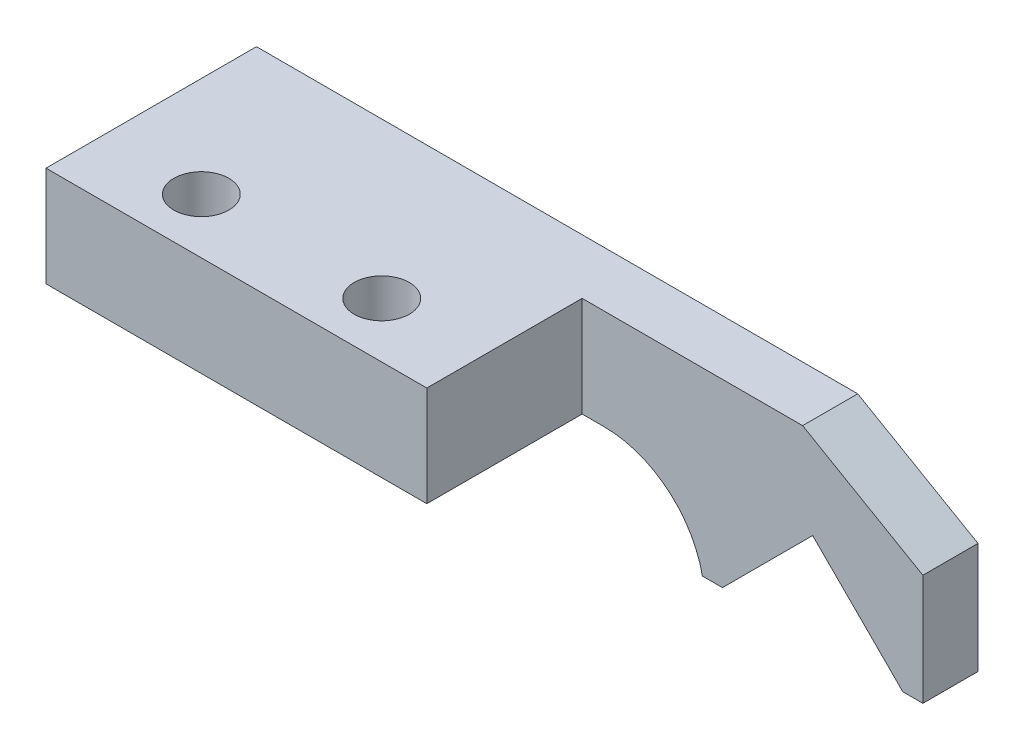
ISO-10303-21;
HEADER;
FILE_DESCRIPTION(('STEP AP214'),'2;1');
FILE_NAME('part.step','',(''),(''),'','','');
FILE_SCHEMA(('AUTOMOTIVE_DESIGN { 1 0 10303 214 1 1 1 1 }'));
ENDSEC;
DATA;
#1=APPLICATION_CONTEXT('core data for automotive mechanical design processes');
#2=APPLICATION_PROTOCOL_DEFINITION('international standard','automotive_design',2000,#1);
#3=PRODUCT_CONTEXT('',#1,'mechanical');
#4=PRODUCT('Part','Part','',(#3));
#5=PRODUCT_RELATED_PRODUCT_CATEGORY('part','',(#4));
#6=PRODUCT_DEFINITION_FORMATION('','',#4);
#7=PRODUCT_DEFINITION_CONTEXT('part definition',#1,'design');
#8=PRODUCT_DEFINITION('design','',#6,#7);
#9=PRODUCT_DEFINITION_SHAPE('','',#8);
#10=(LENGTH_UNIT() NAMED_UNIT(*) SI_UNIT(.MILLI.,.METRE.));
#11=(NAMED_UNIT(*) PLANE_ANGLE_UNIT() SI_UNIT($,.RADIAN.));
#12=(NAMED_UNIT(*) SI_UNIT($,.STERADIAN.) SOLID_ANGLE_UNIT());
#13=UNCERTAINTY_MEASURE_WITH_UNIT(LENGTH_MEASURE(1.E-05),#10,'distance_accuracy_value','');
#14=(GEOMETRIC_REPRESENTATION_CONTEXT(3) GLOBAL_UNCERTAINTY_ASSIGNED_CONTEXT((#13)) GLOBAL_UNIT_ASSIGNED_CONTEXT((#10,
#11,#12)) REPRESENTATION_CONTEXT('',''));
#15=CARTESIAN_POINT('',(0.,0.,0.));
#16=DIRECTION('',(0.,0.,1.));
#17=DIRECTION('',(1.,0.,0.));
#18=AXIS2_PLACEMENT_3D('',#15,#16,#17);
#19=CARTESIAN_POINT('',(40.2020410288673,-10.,21.));
#20=DIRECTION('',(0.,0.,-1.));
#21=DIRECTION('',(-1.,0.,0.));
#22=AXIS2_PLACEMENT_3D('',#19,#20,#21);
#23=CYLINDRICAL_SURFACE('',#22,10.);
#24=DIRECTION('',(0.,0.,-1.));
#25=VECTOR('',#24,1.);
#26=CARTESIAN_POINT('',(50.,-8.,21.));
#27=LINE('',#26,#25);
#28=CARTESIAN_POINT('',(50.,-8.,5.5));
#29=VERTEX_POINT('',#28);
#30=CARTESIAN_POINT('',(50.,-8.,0.));
#31=VERTEX_POINT('',#30);
#32=EDGE_CURVE('E201',#29,#31,#27,.T.);
#33=ORIENTED_EDGE('',*,*,#32,.F.);
#34=CARTESIAN_POINT('',(40.2020410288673,-10.,5.5));
#35=DIRECTION('',(0.,0.,1.));
#36=DIRECTION('',(1.,0.,0.));
#37=AXIS2_PLACEMENT_3D('',#34,#35,#36);
#38=CIRCLE('',#37,10.);
#39=CARTESIAN_POINT('',(40.2020410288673,0.,5.5));
#40=VERTEX_POINT('',#39);
#41=EDGE_CURVE('E158',#29,#40,#38,.T.);
#42=ORIENTED_EDGE('',*,*,#41,.T.);
#43=DIRECTION('',(0.,0.,-1.));
#44=VECTOR('',#43,1.);
#45=CARTESIAN_POINT('',(40.2020410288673,0.,21.));
#46=LINE('',#45,#44);
#47=CARTESIAN_POINT('',(40.2020410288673,0.,0.));
#48=VERTEX_POINT('',#47);
#49=EDGE_CURVE('E42',#40,#48,#46,.T.);
#50=ORIENTED_EDGE('',*,*,#49,.T.);
#51=CARTESIAN_POINT('',(40.2020410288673,-10.,0.));
#52=DIRECTION('',(0.,0.,1.));
#53=DIRECTION('',(1.,0.,0.));
#54=AXIS2_PLACEMENT_3D('',#51,#52,#53);
#55=CIRCLE('',#54,10.);
#56=EDGE_CURVE('E190',#31,#48,#55,.T.);
#57=ORIENTED_EDGE('',*,*,#56,.F.);
#58=EDGE_LOOP('',(#33,#42,#50,#57));
#59=FACE_BOUND('',#58,.T.);
#60=ADVANCED_FACE('F34',(#59),#23,.F.);
#61=CARTESIAN_POINT('',(52.,-8.,21.));
#62=DIRECTION('',(0.,-1.,0.));
#63=DIRECTION('',(0.,0.,-1.));
#64=AXIS2_PLACEMENT_3D('',#61,#62,#63);
#65=PLANE('',#64);
#66=DIRECTION('',(0.,0.,-1.));
#67=VECTOR('',#66,1.);
#68=CARTESIAN_POINT('',(52.,-8.,21.));
#69=LINE('',#68,#67);
#70=CARTESIAN_POINT('',(52.,-8.,5.5));
#71=VERTEX_POINT('',#70);
#72=CARTESIAN_POINT('',(52.,-8.,0.));
#73=VERTEX_POINT('',#72);
#74=EDGE_CURVE('E203',#71,#73,#69,.T.);
#75=ORIENTED_EDGE('',*,*,#74,.F.);
#76=DIRECTION('',(1.,0.,0.));
#77=VECTOR('',#76,1.);
#78=CARTESIAN_POINT('',(38.,-8.,5.5));
#79=LINE('',#78,#77);
#80=EDGE_CURVE('E128',#29,#71,#79,.T.);
#81=ORIENTED_EDGE('',*,*,#80,.F.);
#82=ORIENTED_EDGE('',*,*,#32,.T.);
#83=DIRECTION('',(-1.,0.,0.));
#84=VECTOR('',#83,1.);
#85=CARTESIAN_POINT('',(52.,-8.,0.));
#86=LINE('',#85,#84);
#87=EDGE_CURVE('E187',#73,#31,#86,.T.);
#88=ORIENTED_EDGE('',*,*,#87,.F.);
#89=EDGE_LOOP('',(#75,#81,#82,#88));
#90=FACE_BOUND('',#89,.T.);
#91=ADVANCED_FACE('F235',(#90),#65,.T.);
#92=CARTESIAN_POINT('',(52.,-8.,21.));
#93=DIRECTION('',(-0.707106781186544,0.707106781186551,0.));
#94=DIRECTION('',(-0.707106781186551,-0.707106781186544,0.));
#95=AXIS2_PLACEMENT_3D('',#92,#93,#94);
#96=PLANE('',#95);
#97=DIRECTION('',(0.707106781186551,0.707106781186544,0.));
#98=VECTOR('',#97,1.);
#99=CARTESIAN_POINT('',(52.,-8.,5.5));
#100=LINE('',#99,#98);
#101=CARTESIAN_POINT('',(61.0000000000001,0.999999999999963,5.5));
#102=VERTEX_POINT('',#101);
#103=EDGE_CURVE('E156',#71,#102,#100,.T.);
#104=ORIENTED_EDGE('',*,*,#103,.F.);
#105=ORIENTED_EDGE('',*,*,#74,.T.);
#106=DIRECTION('',(0.707106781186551,0.707106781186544,0.));
#107=VECTOR('',#106,1.);
#108=CARTESIAN_POINT('',(52.,-8.,0.));
#109=LINE('',#108,#107);
#110=CARTESIAN_POINT('',(61.0000000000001,0.999999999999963,0.));
#111=VERTEX_POINT('',#110);
#112=EDGE_CURVE('E184',#73,#111,#109,.T.);
#113=ORIENTED_EDGE('',*,*,#112,.T.);
#114=DIRECTION('',(0.,0.,-1.));
#115=VECTOR('',#114,1.);
#116=CARTESIAN_POINT('',(61.0000000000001,0.999999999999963,21.));
#117=LINE('',#116,#115);
#118=EDGE_CURVE('E205',#102,#111,#117,.T.);
#119=ORIENTED_EDGE('',*,*,#118,.F.);
#120=EDGE_LOOP('',(#104,#105,#113,#119));
#121=FACE_BOUND('',#120,.T.);
#122=ADVANCED_FACE('F237',(#121),#96,.F.);
#123=CARTESIAN_POINT('',(70.,-8.,21.));
#124=DIRECTION('',(-0.707106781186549,-0.707106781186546,0.));
#125=DIRECTION('',(0.707106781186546,-0.707106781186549,0.));
#126=AXIS2_PLACEMENT_3D('',#123,#124,#125);
#127=PLANE('',#126);
#128=DIRECTION('',(0.,0.,-1.));
#129=VECTOR('',#128,1.);
#130=CARTESIAN_POINT('',(70.,-8.,21.));
#131=LINE('',#130,#129);
#132=CARTESIAN_POINT('',(70.,-8.,5.5));
#133=VERTEX_POINT('',#132);
#134=CARTESIAN_POINT('',(70.,-8.,0.));
#135=VERTEX_POINT('',#134);
#136=EDGE_CURVE('E207',#133,#135,#131,.T.);
#137=ORIENTED_EDGE('',*,*,#136,.F.);
#138=DIRECTION('',(-0.707106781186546,0.707106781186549,0.));
#139=VECTOR('',#138,1.);
#140=CARTESIAN_POINT('',(70.,-8.00000000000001,5.5));
#141=LINE('',#140,#139);
#142=EDGE_CURVE('E153',#133,#102,#141,.T.);
#143=ORIENTED_EDGE('',*,*,#142,.T.);
#144=ORIENTED_EDGE('',*,*,#118,.T.);
#145=DIRECTION('',(-0.707106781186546,0.707106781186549,0.));
#146=VECTOR('',#145,1.);
#147=CARTESIAN_POINT('',(70.,-8.,0.));
#148=LINE('',#147,#146);
#149=EDGE_CURVE('E181',#135,#111,#148,.T.);
#150=ORIENTED_EDGE('',*,*,#149,.F.);
#151=EDGE_LOOP('',(#137,#143,#144,#150));
#152=FACE_BOUND('',#151,.T.);
#153=ADVANCED_FACE('F243',(#152),#127,.T.);
#154=CARTESIAN_POINT('',(72.,-8.,21.));
#155=DIRECTION('',(0.,-1.,0.));
#156=DIRECTION('',(0.,0.,-1.));
#157=AXIS2_PLACEMENT_3D('',#154,#155,#156);
#158=PLANE('',#157);
#159=DIRECTION('',(0.,0.,-1.));
#160=VECTOR('',#159,1.);
#161=CARTESIAN_POINT('',(72.,-8.,21.));
#162=LINE('',#161,#160);
#163=CARTESIAN_POINT('',(72.,-8.,5.5));
#164=VERTEX_POINT('',#163);
#165=CARTESIAN_POINT('',(72.,-8.,0.));
#166=VERTEX_POINT('',#165);
#167=EDGE_CURVE('E209',#164,#166,#162,.T.);
#168=ORIENTED_EDGE('',*,*,#167,.F.);
#169=EDGE_CURVE('E136',#133,#164,#79,.T.);
#170=ORIENTED_EDGE('',*,*,#169,.F.);
#171=ORIENTED_EDGE('',*,*,#136,.T.);
#172=DIRECTION('',(-1.,0.,0.));
#173=VECTOR('',#172,1.);
#174=CARTESIAN_POINT('',(72.,-8.,0.));
#175=LINE('',#174,#173);
#176=EDGE_CURVE('E178',#166,#135,#175,.T.);
#177=ORIENTED_EDGE('',*,*,#176,.F.);
#178=EDGE_LOOP('',(#168,#170,#171,#177));
#179=FACE_BOUND('',#178,.T.);
#180=ADVANCED_FACE('F247',(#179),#158,.T.);
#181=CARTESIAN_POINT('',(72.,3.07179676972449,21.));
#182=DIRECTION('',(1.,0.,0.));
#183=DIRECTION('',(0.,1.,0.));
#184=AXIS2_PLACEMENT_3D('',#181,#182,#183);
#185=PLANE('',#184);
#186=DIRECTION('',(0.,0.,-1.));
#187=VECTOR('',#186,1.);
#188=CARTESIAN_POINT('',(72.,3.07179676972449,21.));
#189=LINE('',#188,#187);
#190=CARTESIAN_POINT('',(72.,3.07179676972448,5.50000000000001));
#191=VERTEX_POINT('',#190);
#192=CARTESIAN_POINT('',(72.,3.07179676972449,0.));
#193=VERTEX_POINT('',#192);
#194=EDGE_CURVE('E211',#191,#193,#189,.T.);
#195=ORIENTED_EDGE('',*,*,#194,.F.);
#196=DIRECTION('',(0.,-1.,0.));
#197=VECTOR('',#196,1.);
#198=CARTESIAN_POINT('',(72.,3.07179676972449,5.5));
#199=LINE('',#198,#197);
#200=EDGE_CURVE('E150',#191,#164,#199,.T.);
#201=ORIENTED_EDGE('',*,*,#200,.T.);
#202=ORIENTED_EDGE('',*,*,#167,.T.);
#203=DIRECTION('',(0.,-1.,0.));
#204=VECTOR('',#203,1.);
#205=CARTESIAN_POINT('',(72.,3.07179676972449,0.));
#206=LINE('',#205,#204);
#207=EDGE_CURVE('E175',#193,#166,#206,.T.);
#208=ORIENTED_EDGE('',*,*,#207,.F.);
#209=EDGE_LOOP('',(#195,#201,#202,#208));
#210=FACE_BOUND('',#209,.T.);
#211=ADVANCED_FACE('F251',(#210),#185,.T.);
#212=CARTESIAN_POINT('',(60.,10.,21.));
#213=DIRECTION('',(0.500000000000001,0.866025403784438,0.));
#214=DIRECTION('',(-0.866025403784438,0.500000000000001,0.));
#215=AXIS2_PLACEMENT_3D('',#212,#213,#214);
#216=PLANE('',#215);
#217=DIRECTION('',(0.,0.,-1.));
#218=VECTOR('',#217,1.);
#219=CARTESIAN_POINT('',(60.,10.,21.));
#220=LINE('',#219,#218);
#221=CARTESIAN_POINT('',(60.,10.,5.5));
#222=VERTEX_POINT('',#221);
#223=CARTESIAN_POINT('',(60.,10.,0.));
#224=VERTEX_POINT('',#223);
#225=EDGE_CURVE('E213',#222,#224,#220,.T.);
#226=ORIENTED_EDGE('',*,*,#225,.F.);
#227=DIRECTION('',(0.866025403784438,-0.500000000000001,0.));
#228=VECTOR('',#227,1.);
#229=CARTESIAN_POINT('',(60.,10.,5.5));
#230=LINE('',#229,#228);
#231=EDGE_CURVE('E134',#222,#191,#230,.T.);
#232=ORIENTED_EDGE('',*,*,#231,.T.);
#233=ORIENTED_EDGE('',*,*,#194,.T.);
#234=DIRECTION('',(0.866025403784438,-0.500000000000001,0.));
#235=VECTOR('',#234,1.);
#236=CARTESIAN_POINT('',(60.,10.,0.));
#237=LINE('',#236,#235);
#238=EDGE_CURVE('E172',#224,#193,#237,.T.);
#239=ORIENTED_EDGE('',*,*,#238,.F.);
#240=EDGE_LOOP('',(#226,#232,#233,#239));
#241=FACE_BOUND('',#240,.T.);
#242=ADVANCED_FACE('F253',(#241),#216,.T.);
#243=CARTESIAN_POINT('',(40.2020410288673,0.,21.));
#244=DIRECTION('',(0.,-1.,0.));
#245=DIRECTION('',(0.,0.,-1.));
#246=AXIS2_PLACEMENT_3D('',#243,#244,#245);
#247=PLANE('',#246);
#248=CARTESIAN_POINT('',(10.,0.,15.5));
#249=DIRECTION('',(0.,-1.,0.));
#250=DIRECTION('',(0.,0.,-1.));
#251=AXIS2_PLACEMENT_3D('',#248,#249,#250);
#252=CIRCLE('',#251,5.);
#253=CARTESIAN_POINT('',(10.,0.,10.5));
#254=VERTEX_POINT('',#253);
#255=EDGE_CURVE('E445',#254,#254,#252,.T.);
#256=ORIENTED_EDGE('',*,*,#255,.F.);
#257=EDGE_LOOP('',(#256));
#258=FACE_BOUND('',#257,.T.);
#259=CARTESIAN_POINT('',(28.,0.,15.5));
#260=DIRECTION('',(0.,-1.,0.));
#261=DIRECTION('',(0.,0.,-1.));
#262=AXIS2_PLACEMENT_3D('',#259,#260,#261);
#263=CIRCLE('',#262,5.);
#264=CARTESIAN_POINT('',(28.,0.,10.5));
#265=VERTEX_POINT('',#264);
#266=EDGE_CURVE('E143',#265,#265,#263,.T.);
#267=ORIENTED_EDGE('',*,*,#266,.F.);
#268=EDGE_LOOP('',(#267));
#269=FACE_BOUND('',#268,.T.);
#270=DIRECTION('',(0.,0.,-1.));
#271=VECTOR('',#270,1.);
#272=CARTESIAN_POINT('',(38.,0.,21.));
#273=LINE('',#272,#271);
#274=CARTESIAN_POINT('',(38.,0.,21.));
#275=VERTEX_POINT('',#274);
#276=CARTESIAN_POINT('',(38.,0.,5.5));
#277=VERTEX_POINT('',#276);
#278=EDGE_CURVE('E125',#275,#277,#273,.T.);
#279=ORIENTED_EDGE('',*,*,#278,.F.);
#280=DIRECTION('',(-1.,0.,0.));
#281=VECTOR('',#280,1.);
#282=CARTESIAN_POINT('',(40.2020410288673,0.,21.));
#283=LINE('',#282,#281);
#284=CARTESIAN_POINT('',(0.,0.,21.));
#285=VERTEX_POINT('',#284);
#286=EDGE_CURVE('E193',#275,#285,#283,.T.);
#287=ORIENTED_EDGE('',*,*,#286,.T.);
#288=DIRECTION('',(0.,0.,-1.));
#289=VECTOR('',#288,1.);
#290=CARTESIAN_POINT('',(0.,0.,21.));
#291=LINE('',#290,#289);
#292=CARTESIAN_POINT('',(0.,0.,0.));
#293=VERTEX_POINT('',#292);
#294=EDGE_CURVE('E199',#285,#293,#291,.T.);
#295=ORIENTED_EDGE('',*,*,#294,.T.);
#296=DIRECTION('',(-1.,0.,0.));
#297=VECTOR('',#296,1.);
#298=CARTESIAN_POINT('',(40.2020410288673,0.,0.));
#299=LINE('',#298,#297);
#300=EDGE_CURVE('E163',#48,#293,#299,.T.);
#301=ORIENTED_EDGE('',*,*,#300,.F.);
#302=ORIENTED_EDGE('',*,*,#49,.F.);
#303=DIRECTION('',(-1.,0.,0.));
#304=VECTOR('',#303,1.);
#305=CARTESIAN_POINT('',(40.2020410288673,0.,5.5));
#306=LINE('',#305,#304);
#307=EDGE_CURVE('E161',#40,#277,#306,.T.);
#308=ORIENTED_EDGE('',*,*,#307,.T.);
#309=EDGE_LOOP('',(#279,#287,#295,#301,#302,#308));
#310=FACE_BOUND('',#309,.T.);
#311=ADVANCED_FACE('F36',(#258,#269,#310),#247,.T.);
#312=CARTESIAN_POINT('',(0.,10.,21.));
#313=DIRECTION('',(0.,1.,0.));
#314=DIRECTION('',(0.,0.,1.));
#315=AXIS2_PLACEMENT_3D('',#312,#313,#314);
#316=PLANE('',#315);
#317=CARTESIAN_POINT('',(10.,10.,15.5));
#318=DIRECTION('',(0.,1.,0.));
#319=DIRECTION('',(0.,0.,1.));
#320=AXIS2_PLACEMENT_3D('',#317,#318,#319);
#321=CIRCLE('',#320,2.75);
#322=CARTESIAN_POINT('',(10.,10.,18.25));
#323=VERTEX_POINT('',#322);
#324=EDGE_CURVE('E432',#323,#323,#321,.T.);
#325=ORIENTED_EDGE('',*,*,#324,.F.);
#326=EDGE_LOOP('',(#325));
#327=FACE_BOUND('',#326,.T.);
#328=CARTESIAN_POINT('',(28.,10.,15.5));
#329=DIRECTION('',(0.,1.,0.));
#330=DIRECTION('',(0.,0.,1.));
#331=AXIS2_PLACEMENT_3D('',#328,#329,#330);
#332=CIRCLE('',#331,2.75);
#333=CARTESIAN_POINT('',(28.,10.,18.25));
#334=VERTEX_POINT('',#333);
#335=EDGE_CURVE('E442',#334,#334,#332,.T.);
#336=ORIENTED_EDGE('',*,*,#335,.F.);
#337=EDGE_LOOP('',(#336));
#338=FACE_BOUND('',#337,.T.);
#339=DIRECTION('',(0.,0.,1.));
#340=VECTOR('',#339,1.);
#341=CARTESIAN_POINT('',(38.,10.,5.5));
#342=LINE('',#341,#340);
#343=CARTESIAN_POINT('',(38.,10.,5.5));
#344=VERTEX_POINT('',#343);
#345=CARTESIAN_POINT('',(38.,10.,21.));
#346=VERTEX_POINT('',#345);
#347=EDGE_CURVE('E48',#344,#346,#342,.T.);
#348=ORIENTED_EDGE('',*,*,#347,.F.);
#349=DIRECTION('',(1.,0.,0.));
#350=VECTOR('',#349,1.);
#351=CARTESIAN_POINT('',(38.,10.,5.5));
#352=LINE('',#351,#350);
#353=EDGE_CURVE('E131',#344,#222,#352,.T.);
#354=ORIENTED_EDGE('',*,*,#353,.T.);
#355=ORIENTED_EDGE('',*,*,#225,.T.);
#356=DIRECTION('',(1.,0.,0.));
#357=VECTOR('',#356,1.);
#358=CARTESIAN_POINT('',(0.,10.,0.));
#359=LINE('',#358,#357);
#360=CARTESIAN_POINT('',(0.,10.,0.));
#361=VERTEX_POINT('',#360);
#362=EDGE_CURVE('E169',#361,#224,#359,.T.);
#363=ORIENTED_EDGE('',*,*,#362,.F.);
#364=DIRECTION('',(0.,0.,-1.));
#365=VECTOR('',#364,1.);
#366=CARTESIAN_POINT('',(0.,10.,21.));
#367=LINE('',#366,#365);
#368=CARTESIAN_POINT('',(0.,10.,21.));
#369=VERTEX_POINT('',#368);
#370=EDGE_CURVE('E56',#369,#361,#367,.T.);
#371=ORIENTED_EDGE('',*,*,#370,.F.);
#372=DIRECTION('',(1.,0.,0.));
#373=VECTOR('',#372,1.);
#374=CARTESIAN_POINT('',(0.,10.,21.));
#375=LINE('',#374,#373);
#376=EDGE_CURVE('E139',#369,#346,#375,.T.);
#377=ORIENTED_EDGE('',*,*,#376,.T.);
#378=EDGE_LOOP('',(#348,#354,#355,#363,#371,#377));
#379=FACE_BOUND('',#378,.T.);
#380=ADVANCED_FACE('F138',(#327,#338,#379),#316,.T.);
#381=CARTESIAN_POINT('',(0.,0.,21.));
#382=DIRECTION('',(-1.,0.,0.));
#383=DIRECTION('',(0.,0.,1.));
#384=AXIS2_PLACEMENT_3D('',#381,#382,#383);
#385=PLANE('',#384);
#386=DIRECTION('',(0.,1.,0.));
#387=VECTOR('',#386,1.);
#388=CARTESIAN_POINT('',(0.,0.,0.));
#389=LINE('',#388,#387);
#390=EDGE_CURVE('E166',#293,#361,#389,.T.);
#391=ORIENTED_EDGE('',*,*,#390,.F.);
#392=ORIENTED_EDGE('',*,*,#294,.F.);
#393=DIRECTION('',(0.,1.,0.));
#394=VECTOR('',#393,1.);
#395=CARTESIAN_POINT('',(0.,0.,21.));
#396=LINE('',#395,#394);
#397=EDGE_CURVE('E195',#285,#369,#396,.T.);
#398=ORIENTED_EDGE('',*,*,#397,.T.);
#399=ORIENTED_EDGE('',*,*,#370,.T.);
#400=EDGE_LOOP('',(#391,#392,#398,#399));
#401=FACE_BOUND('',#400,.T.);
#402=ADVANCED_FACE('F223',(#401),#385,.T.);
#403=CARTESIAN_POINT('',(40.2020410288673,-10.,21.));
#404=DIRECTION('',(0.,0.,1.));
#405=DIRECTION('',(1.,0.,0.));
#406=AXIS2_PLACEMENT_3D('',#403,#404,#405);
#407=PLANE('',#406);
#408=DIRECTION('',(0.,-1.,0.));
#409=VECTOR('',#408,1.);
#410=CARTESIAN_POINT('',(38.,-10.,21.));
#411=LINE('',#410,#409);
#412=EDGE_CURVE('E11',#346,#275,#411,.T.);
#413=ORIENTED_EDGE('',*,*,#412,.F.);
#414=ORIENTED_EDGE('',*,*,#376,.F.);
#415=ORIENTED_EDGE('',*,*,#397,.F.);
#416=ORIENTED_EDGE('',*,*,#286,.F.);
#417=EDGE_LOOP('',(#413,#414,#415,#416));
#418=FACE_BOUND('',#417,.T.);
#419=ADVANCED_FACE('F271',(#418),#407,.T.);
#420=CARTESIAN_POINT('',(40.2020410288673,-10.,0.));
#421=DIRECTION('',(0.,0.,1.));
#422=DIRECTION('',(1.,0.,0.));
#423=AXIS2_PLACEMENT_3D('',#420,#421,#422);
#424=PLANE('',#423);
#425=ORIENTED_EDGE('',*,*,#300,.T.);
#426=ORIENTED_EDGE('',*,*,#390,.T.);
#427=ORIENTED_EDGE('',*,*,#362,.T.);
#428=ORIENTED_EDGE('',*,*,#238,.T.);
#429=ORIENTED_EDGE('',*,*,#207,.T.);
#430=ORIENTED_EDGE('',*,*,#176,.T.);
#431=ORIENTED_EDGE('',*,*,#149,.T.);
#432=ORIENTED_EDGE('',*,*,#112,.F.);
#433=ORIENTED_EDGE('',*,*,#87,.T.);
#434=ORIENTED_EDGE('',*,*,#56,.T.);
#435=EDGE_LOOP('',(#425,#426,#427,#428,#429,#430,#431,#432,#433,#434));
#436=FACE_BOUND('',#435,.T.);
#437=ADVANCED_FACE('F225',(#436),#424,.F.);
#438=CARTESIAN_POINT('',(38.,-8.,5.5));
#439=DIRECTION('',(0.,0.,1.));
#440=DIRECTION('',(1.,0.,0.));
#441=AXIS2_PLACEMENT_3D('',#438,#439,#440);
#442=PLANE('',#441);
#443=ORIENTED_EDGE('',*,*,#41,.F.);
#444=ORIENTED_EDGE('',*,*,#80,.T.);
#445=ORIENTED_EDGE('',*,*,#103,.T.);
#446=ORIENTED_EDGE('',*,*,#142,.F.);
#447=ORIENTED_EDGE('',*,*,#169,.T.);
#448=ORIENTED_EDGE('',*,*,#200,.F.);
#449=ORIENTED_EDGE('',*,*,#231,.F.);
#450=ORIENTED_EDGE('',*,*,#353,.F.);
#451=DIRECTION('',(0.,1.,0.));
#452=VECTOR('',#451,1.);
#453=CARTESIAN_POINT('',(38.,-8.,5.5));
#454=LINE('',#453,#452);
#455=EDGE_CURVE('E121',#277,#344,#454,.T.);
#456=ORIENTED_EDGE('',*,*,#455,.F.);
#457=ORIENTED_EDGE('',*,*,#307,.F.);
#458=EDGE_LOOP('',(#443,#444,#445,#446,#447,#448,#449,#450,#456,#457));
#459=FACE_BOUND('',#458,.T.);
#460=ADVANCED_FACE('F132',(#459),#442,.T.);
#461=CARTESIAN_POINT('',(38.,-8.,5.5));
#462=DIRECTION('',(-1.,0.,0.));
#463=DIRECTION('',(0.,0.,1.));
#464=AXIS2_PLACEMENT_3D('',#461,#462,#463);
#465=PLANE('',#464);
#466=ORIENTED_EDGE('',*,*,#278,.T.);
#467=ORIENTED_EDGE('',*,*,#455,.T.);
#468=ORIENTED_EDGE('',*,*,#347,.T.);
#469=ORIENTED_EDGE('',*,*,#412,.T.);
#470=EDGE_LOOP('',(#466,#467,#468,#469));
#471=FACE_BOUND('',#470,.T.);
#472=ADVANCED_FACE('F123',(#471),#465,.F.);
#473=CARTESIAN_POINT('',(28.,6.,15.5));
#474=DIRECTION('',(0.,-1.,0.));
#475=DIRECTION('',(0.,0.,-1.));
#476=AXIS2_PLACEMENT_3D('',#473,#474,#475);
#477=CYLINDRICAL_SURFACE('',#476,5.);
#478=CARTESIAN_POINT('',(28.,6.,15.5));
#479=DIRECTION('',(0.,-1.,0.));
#480=DIRECTION('',(0.,0.,-1.));
#481=AXIS2_PLACEMENT_3D('',#478,#479,#480);
#482=CIRCLE('',#481,5.);
#483=CARTESIAN_POINT('',(28.,6.,10.5));
#484=VERTEX_POINT('',#483);
#485=EDGE_CURVE('E140',#484,#484,#482,.T.);
#486=ORIENTED_EDGE('',*,*,#485,.F.);
#487=EDGE_LOOP('',(#486));
#488=FACE_BOUND('',#487,.T.);
#489=ORIENTED_EDGE('',*,*,#266,.T.);
#490=EDGE_LOOP('',(#489));
#491=FACE_BOUND('',#490,.T.);
#492=ADVANCED_FACE('F321',(#488,#491),#477,.F.);
#493=CARTESIAN_POINT('',(28.,6.,15.5));
#494=DIRECTION('',(0.,-1.,0.));
#495=DIRECTION('',(0.,0.,-1.));
#496=AXIS2_PLACEMENT_3D('',#493,#494,#495);
#497=PLANE('',#496);
#498=CARTESIAN_POINT('',(28.,6.,15.5));
#499=DIRECTION('',(0.,-1.,0.));
#500=DIRECTION('',(0.,0.,-1.));
#501=AXIS2_PLACEMENT_3D('',#498,#499,#500);
#502=CIRCLE('',#501,2.75);
#503=CARTESIAN_POINT('',(28.,6.,12.75));
#504=VERTEX_POINT('',#503);
#505=EDGE_CURVE('E437',#504,#504,#502,.T.);
#506=ORIENTED_EDGE('',*,*,#505,.F.);
#507=EDGE_LOOP('',(#506));
#508=FACE_BOUND('',#507,.T.);
#509=ORIENTED_EDGE('',*,*,#485,.T.);
#510=EDGE_LOOP('',(#509));
#511=FACE_BOUND('',#510,.T.);
#512=ADVANCED_FACE('F338',(#508,#511),#497,.T.);
#513=CARTESIAN_POINT('',(10.,6.,15.5));
#514=DIRECTION('',(0.,-1.,0.));
#515=DIRECTION('',(0.,0.,-1.));
#516=AXIS2_PLACEMENT_3D('',#513,#514,#515);
#517=CYLINDRICAL_SURFACE('',#516,5.);
#518=CARTESIAN_POINT('',(10.,6.,15.5));
#519=DIRECTION('',(0.,-1.,0.));
#520=DIRECTION('',(0.,0.,-1.));
#521=AXIS2_PLACEMENT_3D('',#518,#519,#520);
#522=CIRCLE('',#521,5.);
#523=CARTESIAN_POINT('',(10.,6.,10.5));
#524=VERTEX_POINT('',#523);
#525=EDGE_CURVE('E448',#524,#524,#522,.T.);
#526=ORIENTED_EDGE('',*,*,#525,.F.);
#527=EDGE_LOOP('',(#526));
#528=FACE_BOUND('',#527,.T.);
#529=ORIENTED_EDGE('',*,*,#255,.T.);
#530=EDGE_LOOP('',(#529));
#531=FACE_BOUND('',#530,.T.);
#532=ADVANCED_FACE('F346',(#528,#531),#517,.F.);
#533=CARTESIAN_POINT('',(10.,6.,15.5));
#534=DIRECTION('',(0.,-1.,0.));
#535=DIRECTION('',(0.,0.,-1.));
#536=AXIS2_PLACEMENT_3D('',#533,#534,#535);
#537=PLANE('',#536);
#538=CARTESIAN_POINT('',(10.,6.,15.5));
#539=DIRECTION('',(0.,-1.,0.));
#540=DIRECTION('',(0.,0.,-1.));
#541=AXIS2_PLACEMENT_3D('',#538,#539,#540);
#542=CIRCLE('',#541,2.75);
#543=CARTESIAN_POINT('',(10.,6.,12.75));
#544=VERTEX_POINT('',#543);
#545=EDGE_CURVE('E435',#544,#544,#542,.T.);
#546=ORIENTED_EDGE('',*,*,#545,.F.);
#547=EDGE_LOOP('',(#546));
#548=FACE_BOUND('',#547,.T.);
#549=ORIENTED_EDGE('',*,*,#525,.T.);
#550=EDGE_LOOP('',(#549));
#551=FACE_BOUND('',#550,.T.);
#552=ADVANCED_FACE('F351',(#548,#551),#537,.T.);
#553=CARTESIAN_POINT('',(28.,12.,15.5));
#554=DIRECTION('',(0.,-1.,0.));
#555=DIRECTION('',(0.,0.,-1.));
#556=AXIS2_PLACEMENT_3D('',#553,#554,#555);
#557=CYLINDRICAL_SURFACE('',#556,2.75);
#558=ORIENTED_EDGE('',*,*,#335,.T.);
#559=EDGE_LOOP('',(#558));
#560=FACE_BOUND('',#559,.T.);
#561=ORIENTED_EDGE('',*,*,#505,.T.);
#562=EDGE_LOOP('',(#561));
#563=FACE_BOUND('',#562,.T.);
#564=ADVANCED_FACE('F374',(#560,#563),#557,.F.);
#565=CARTESIAN_POINT('',(10.,12.,15.5));
#566=DIRECTION('',(0.,-1.,0.));
#567=DIRECTION('',(0.,0.,-1.));
#568=AXIS2_PLACEMENT_3D('',#565,#566,#567);
#569=CYLINDRICAL_SURFACE('',#568,2.75);
#570=ORIENTED_EDGE('',*,*,#324,.T.);
#571=EDGE_LOOP('',(#570));
#572=FACE_BOUND('',#571,.T.);
#573=ORIENTED_EDGE('',*,*,#545,.T.);
#574=EDGE_LOOP('',(#573));
#575=FACE_BOUND('',#574,.T.);
#576=ADVANCED_FACE('F384',(#572,#575),#569,.F.);
#577=CLOSED_SHELL('',(#60,#91,#122,#153,#180,#211,#242,#311,#380,#402,#419,#437,#460,#472,#492,
#512,#532,#552,#564,#576));
#578=MANIFOLD_SOLID_BREP('B2',#577);
#579=ADVANCED_BREP_SHAPE_REPRESENTATION('',(#18,#578),#14);
#580=SHAPE_DEFINITION_REPRESENTATION(#9,#579);
ENDSEC;
END-ISO-10303-21;
